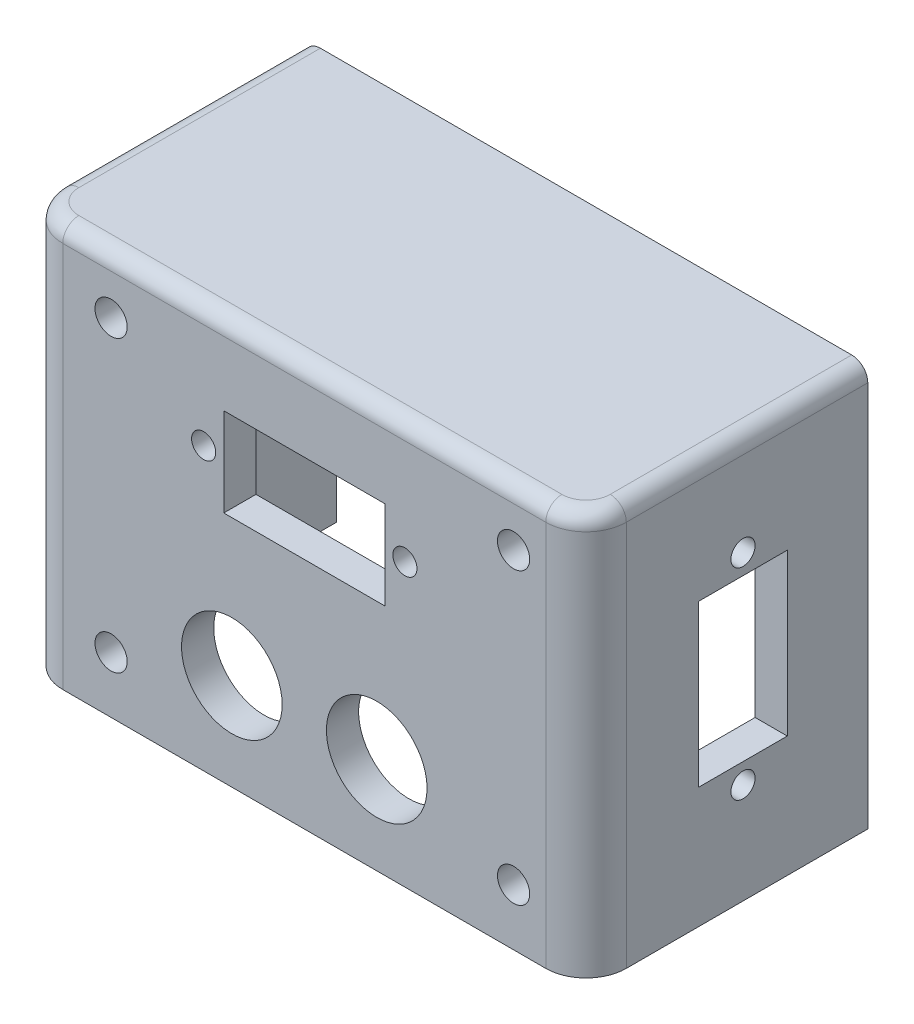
ISO-10303-21;
HEADER;
FILE_DESCRIPTION(('STEP AP214'),'2;1');
FILE_NAME('part.step','',(''),(''),'','','');
FILE_SCHEMA(('AUTOMOTIVE_DESIGN { 1 0 10303 214 1 1 1 1 }'));
ENDSEC;
DATA;
#1=APPLICATION_CONTEXT('core data for automotive mechanical design processes');
#2=APPLICATION_PROTOCOL_DEFINITION('international standard','automotive_design',2000,#1);
#3=PRODUCT_CONTEXT('',#1,'mechanical');
#4=PRODUCT('Part','Part','',(#3));
#5=PRODUCT_RELATED_PRODUCT_CATEGORY('part','',(#4));
#6=PRODUCT_DEFINITION_FORMATION('','',#4);
#7=PRODUCT_DEFINITION_CONTEXT('part definition',#1,'design');
#8=PRODUCT_DEFINITION('design','',#6,#7);
#9=PRODUCT_DEFINITION_SHAPE('','',#8);
#10=(LENGTH_UNIT() NAMED_UNIT(*) SI_UNIT(.MILLI.,.METRE.));
#11=(NAMED_UNIT(*) PLANE_ANGLE_UNIT() SI_UNIT($,.RADIAN.));
#12=(NAMED_UNIT(*) SI_UNIT($,.STERADIAN.) SOLID_ANGLE_UNIT());
#13=UNCERTAINTY_MEASURE_WITH_UNIT(LENGTH_MEASURE(1.E-05),#10,'distance_accuracy_value','');
#14=(GEOMETRIC_REPRESENTATION_CONTEXT(3) GLOBAL_UNCERTAINTY_ASSIGNED_CONTEXT((#13)) GLOBAL_UNIT_ASSIGNED_CONTEXT((#10,
#11,#12)) REPRESENTATION_CONTEXT('',''));
#15=CARTESIAN_POINT('',(0.,0.,0.));
#16=DIRECTION('',(0.,0.,1.));
#17=DIRECTION('',(1.,0.,0.));
#18=AXIS2_PLACEMENT_3D('',#15,#16,#17);
#19=CARTESIAN_POINT('',(66.,0.,0.));
#20=DIRECTION('',(1.,0.,0.));
#21=DIRECTION('',(0.,0.,-1.));
#22=AXIS2_PLACEMENT_3D('',#19,#20,#21);
#23=PLANE('',#22);
#24=DIRECTION('',(0.,0.,-1.));
#25=VECTOR('',#24,1.);
#26=CARTESIAN_POINT('',(66.,15.,0.));
#27=LINE('',#26,#25);
#28=CARTESIAN_POINT('',(66.,15.,21.));
#29=VERTEX_POINT('',#28);
#30=CARTESIAN_POINT('',(66.,15.,10.));
#31=VERTEX_POINT('',#30);
#32=EDGE_CURVE('E326',#29,#31,#27,.T.);
#33=ORIENTED_EDGE('',*,*,#32,.T.);
#34=DIRECTION('',(0.,1.,0.));
#35=VECTOR('',#34,1.);
#36=CARTESIAN_POINT('',(66.,0.,10.));
#37=LINE('',#36,#35);
#38=CARTESIAN_POINT('',(66.,35.,10.));
#39=VERTEX_POINT('',#38);
#40=EDGE_CURVE('E346',#31,#39,#37,.T.);
#41=ORIENTED_EDGE('',*,*,#40,.T.);
#42=DIRECTION('',(0.,0.,1.));
#43=VECTOR('',#42,1.);
#44=CARTESIAN_POINT('',(66.,35.,0.));
#45=LINE('',#44,#43);
#46=CARTESIAN_POINT('',(66.,35.,21.));
#47=VERTEX_POINT('',#46);
#48=EDGE_CURVE('E343',#39,#47,#45,.T.);
#49=ORIENTED_EDGE('',*,*,#48,.T.);
#50=DIRECTION('',(0.,-1.,0.));
#51=VECTOR('',#50,1.);
#52=CARTESIAN_POINT('',(66.,0.,21.));
#53=LINE('',#52,#51);
#54=EDGE_CURVE('E340',#47,#29,#53,.T.);
#55=ORIENTED_EDGE('',*,*,#54,.T.);
#56=EDGE_LOOP('',(#33,#41,#49,#55));
#57=FACE_BOUND('',#56,.T.);
#58=CARTESIAN_POINT('',(66.,12.5,15.5));
#59=DIRECTION('',(1.,0.,0.));
#60=DIRECTION('',(0.,0.,-1.));
#61=AXIS2_PLACEMENT_3D('',#58,#59,#60);
#62=CIRCLE('',#61,1.5);
#63=CARTESIAN_POINT('',(66.,12.5,14.));
#64=VERTEX_POINT('',#63);
#65=EDGE_CURVE('E296',#64,#64,#62,.T.);
#66=ORIENTED_EDGE('',*,*,#65,.T.);
#67=EDGE_LOOP('',(#66));
#68=FACE_BOUND('',#67,.T.);
#69=CARTESIAN_POINT('',(66.,37.5,15.5));
#70=DIRECTION('',(1.,0.,0.));
#71=DIRECTION('',(0.,0.,-1.));
#72=AXIS2_PLACEMENT_3D('',#69,#70,#71);
#73=CIRCLE('',#72,1.5);
#74=CARTESIAN_POINT('',(66.,37.5,14.));
#75=VERTEX_POINT('',#74);
#76=EDGE_CURVE('E286',#75,#75,#73,.T.);
#77=ORIENTED_EDGE('',*,*,#76,.T.);
#78=EDGE_LOOP('',(#77));
#79=FACE_BOUND('',#78,.T.);
#80=DIRECTION('',(0.,0.,-1.));
#81=VECTOR('',#80,1.);
#82=CARTESIAN_POINT('',(66.,48.,0.));
#83=LINE('',#82,#81);
#84=CARTESIAN_POINT('',(66.,48.,29.));
#85=VERTEX_POINT('',#84);
#86=CARTESIAN_POINT('',(66.,48.,0.));
#87=VERTEX_POINT('',#86);
#88=EDGE_CURVE('E268',#85,#87,#83,.T.);
#89=ORIENTED_EDGE('',*,*,#88,.T.);
#90=DIRECTION('',(0.,1.,0.));
#91=VECTOR('',#90,1.);
#92=CARTESIAN_POINT('',(66.,0.,0.));
#93=LINE('',#92,#91);
#94=CARTESIAN_POINT('',(66.,0.,0.));
#95=VERTEX_POINT('',#94);
#96=EDGE_CURVE('E388',#95,#87,#93,.T.);
#97=ORIENTED_EDGE('',*,*,#96,.F.);
#98=DIRECTION('',(0.,0.,-1.));
#99=VECTOR('',#98,1.);
#100=CARTESIAN_POINT('',(66.,0.,0.));
#101=LINE('',#100,#99);
#102=CARTESIAN_POINT('',(66.,0.,29.));
#103=VERTEX_POINT('',#102);
#104=EDGE_CURVE('E373',#103,#95,#101,.T.);
#105=ORIENTED_EDGE('',*,*,#104,.F.);
#106=DIRECTION('',(0.,1.,0.));
#107=VECTOR('',#106,1.);
#108=CARTESIAN_POINT('',(66.,0.,29.));
#109=LINE('',#108,#107);
#110=EDGE_CURVE('E389',#103,#85,#109,.T.);
#111=ORIENTED_EDGE('',*,*,#110,.T.);
#112=EDGE_LOOP('',(#89,#97,#105,#111));
#113=FACE_BOUND('',#112,.T.);
#114=ADVANCED_FACE('F35',(#57,#68,#79,#113),#23,.F.);
#115=CARTESIAN_POINT('',(64.,0.,29.));
#116=DIRECTION('',(0.,1.,0.));
#117=DIRECTION('',(0.,0.,1.));
#118=AXIS2_PLACEMENT_3D('',#115,#116,#117);
#119=CYLINDRICAL_SURFACE('',#118,1.99999999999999);
#120=CARTESIAN_POINT('',(64.,48.,29.));
#121=DIRECTION('',(0.,1.,0.));
#122=DIRECTION('',(0.,0.,1.));
#123=AXIS2_PLACEMENT_3D('',#120,#121,#122);
#124=CIRCLE('',#123,1.99999999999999);
#125=CARTESIAN_POINT('',(64.,48.,31.));
#126=VERTEX_POINT('',#125);
#127=EDGE_CURVE('E276',#85,#126,#124,.F.);
#128=ORIENTED_EDGE('',*,*,#127,.F.);
#129=ORIENTED_EDGE('',*,*,#110,.F.);
#130=CARTESIAN_POINT('',(64.,0.,29.));
#131=DIRECTION('',(0.,1.,0.));
#132=DIRECTION('',(0.,0.,1.));
#133=AXIS2_PLACEMENT_3D('',#130,#131,#132);
#134=CIRCLE('',#133,1.99999999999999);
#135=CARTESIAN_POINT('',(64.,0.,31.));
#136=VERTEX_POINT('',#135);
#137=EDGE_CURVE('E385',#136,#103,#134,.T.);
#138=ORIENTED_EDGE('',*,*,#137,.F.);
#139=DIRECTION('',(0.,1.,0.));
#140=VECTOR('',#139,1.);
#141=CARTESIAN_POINT('',(64.,0.,31.));
#142=LINE('',#141,#140);
#143=EDGE_CURVE('E393',#136,#126,#142,.T.);
#144=ORIENTED_EDGE('',*,*,#143,.T.);
#145=EDGE_LOOP('',(#128,#129,#138,#144));
#146=FACE_BOUND('',#145,.T.);
#147=ADVANCED_FACE('F550',(#146),#119,.F.);
#148=CARTESIAN_POINT('',(64.,0.,31.));
#149=DIRECTION('',(0.,0.,1.));
#150=DIRECTION('',(1.,0.,0.));
#151=AXIS2_PLACEMENT_3D('',#148,#149,#150);
#152=PLANE('',#151);
#153=CARTESIAN_POINT('',(47.5,35.,31.));
#154=DIRECTION('',(0.,0.,1.));
#155=DIRECTION('',(1.,0.,0.));
#156=AXIS2_PLACEMENT_3D('',#153,#154,#155);
#157=CIRCLE('',#156,1.5);
#158=CARTESIAN_POINT('',(49.,35.,31.));
#159=VERTEX_POINT('',#158);
#160=EDGE_CURVE('E932',#159,#159,#157,.F.);
#161=ORIENTED_EDGE('',*,*,#160,.F.);
#162=EDGE_LOOP('',(#161));
#163=FACE_BOUND('',#162,.T.);
#164=CARTESIAN_POINT('',(22.5,35.,31.));
#165=DIRECTION('',(0.,0.,1.));
#166=DIRECTION('',(1.,0.,0.));
#167=AXIS2_PLACEMENT_3D('',#164,#165,#166);
#168=CIRCLE('',#167,1.5);
#169=CARTESIAN_POINT('',(24.,35.,31.));
#170=VERTEX_POINT('',#169);
#171=EDGE_CURVE('E936',#170,#170,#168,.F.);
#172=ORIENTED_EDGE('',*,*,#171,.F.);
#173=EDGE_LOOP('',(#172));
#174=FACE_BOUND('',#173,.T.);
#175=DIRECTION('',(1.,0.,0.));
#176=VECTOR('',#175,1.);
#177=CARTESIAN_POINT('',(25.,40.,31.));
#178=LINE('',#177,#176);
#179=CARTESIAN_POINT('',(25.,40.,31.));
#180=VERTEX_POINT('',#179);
#181=CARTESIAN_POINT('',(45.,40.,31.));
#182=VERTEX_POINT('',#181);
#183=EDGE_CURVE('E235',#180,#182,#178,.T.);
#184=ORIENTED_EDGE('',*,*,#183,.F.);
#185=DIRECTION('',(0.,1.,0.));
#186=VECTOR('',#185,1.);
#187=CARTESIAN_POINT('',(25.,29.,31.));
#188=LINE('',#187,#186);
#189=CARTESIAN_POINT('',(25.,29.,31.));
#190=VERTEX_POINT('',#189);
#191=EDGE_CURVE('E217',#190,#180,#188,.T.);
#192=ORIENTED_EDGE('',*,*,#191,.F.);
#193=DIRECTION('',(-1.,0.,0.));
#194=VECTOR('',#193,1.);
#195=CARTESIAN_POINT('',(25.,29.,31.));
#196=LINE('',#195,#194);
#197=CARTESIAN_POINT('',(45.,29.,31.));
#198=VERTEX_POINT('',#197);
#199=EDGE_CURVE('E226',#198,#190,#196,.T.);
#200=ORIENTED_EDGE('',*,*,#199,.F.);
#201=DIRECTION('',(0.,-1.,0.));
#202=VECTOR('',#201,1.);
#203=CARTESIAN_POINT('',(45.,29.,31.));
#204=LINE('',#203,#202);
#205=EDGE_CURVE('E52',#182,#198,#204,.T.);
#206=ORIENTED_EDGE('',*,*,#205,.F.);
#207=EDGE_LOOP('',(#184,#192,#200,#206));
#208=FACE_BOUND('',#207,.T.);
#209=CARTESIAN_POINT('',(44.,12.,31.));
#210=DIRECTION('',(0.,0.,1.));
#211=DIRECTION('',(1.,0.,0.));
#212=AXIS2_PLACEMENT_3D('',#209,#210,#211);
#213=CIRCLE('',#212,6.25);
#214=CARTESIAN_POINT('',(50.25,12.,31.));
#215=VERTEX_POINT('',#214);
#216=EDGE_CURVE('E254',#215,#215,#213,.F.);
#217=ORIENTED_EDGE('',*,*,#216,.F.);
#218=EDGE_LOOP('',(#217));
#219=FACE_BOUND('',#218,.T.);
#220=CARTESIAN_POINT('',(26.,12.,31.));
#221=DIRECTION('',(0.,0.,1.));
#222=DIRECTION('',(1.,0.,0.));
#223=AXIS2_PLACEMENT_3D('',#220,#221,#222);
#224=CIRCLE('',#223,6.25);
#225=CARTESIAN_POINT('',(32.25,12.,31.));
#226=VERTEX_POINT('',#225);
#227=EDGE_CURVE('E260',#226,#226,#224,.F.);
#228=ORIENTED_EDGE('',*,*,#227,.F.);
#229=EDGE_LOOP('',(#228));
#230=FACE_BOUND('',#229,.T.);
#231=CARTESIAN_POINT('',(11.,43.,31.));
#232=DIRECTION('',(0.,0.,1.));
#233=DIRECTION('',(1.,0.,0.));
#234=AXIS2_PLACEMENT_3D('',#231,#232,#233);
#235=CIRCLE('',#234,2.);
#236=CARTESIAN_POINT('',(13.,43.,31.));
#237=VERTEX_POINT('',#236);
#238=EDGE_CURVE('E370',#237,#237,#235,.F.);
#239=ORIENTED_EDGE('',*,*,#238,.F.);
#240=EDGE_LOOP('',(#239));
#241=FACE_BOUND('',#240,.T.);
#242=CARTESIAN_POINT('',(11.,7.00000000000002,31.));
#243=DIRECTION('',(0.,0.,1.));
#244=DIRECTION('',(1.,0.,0.));
#245=AXIS2_PLACEMENT_3D('',#242,#243,#244);
#246=CIRCLE('',#245,2.);
#247=CARTESIAN_POINT('',(13.,7.00000000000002,31.));
#248=VERTEX_POINT('',#247);
#249=EDGE_CURVE('E364',#248,#248,#246,.F.);
#250=ORIENTED_EDGE('',*,*,#249,.F.);
#251=EDGE_LOOP('',(#250));
#252=FACE_BOUND('',#251,.T.);
#253=CARTESIAN_POINT('',(61.,7.00000000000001,31.));
#254=DIRECTION('',(0.,0.,1.));
#255=DIRECTION('',(1.,0.,0.));
#256=AXIS2_PLACEMENT_3D('',#253,#254,#255);
#257=CIRCLE('',#256,1.99999999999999);
#258=CARTESIAN_POINT('',(63.,7.00000000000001,31.));
#259=VERTEX_POINT('',#258);
#260=EDGE_CURVE('E358',#259,#259,#257,.F.);
#261=ORIENTED_EDGE('',*,*,#260,.F.);
#262=EDGE_LOOP('',(#261));
#263=FACE_BOUND('',#262,.T.);
#264=CARTESIAN_POINT('',(61.,43.,31.));
#265=DIRECTION('',(0.,0.,1.));
#266=DIRECTION('',(1.,0.,0.));
#267=AXIS2_PLACEMENT_3D('',#264,#265,#266);
#268=CIRCLE('',#267,1.99999999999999);
#269=CARTESIAN_POINT('',(63.,43.,31.));
#270=VERTEX_POINT('',#269);
#271=EDGE_CURVE('E352',#270,#270,#268,.F.);
#272=ORIENTED_EDGE('',*,*,#271,.F.);
#273=EDGE_LOOP('',(#272));
#274=FACE_BOUND('',#273,.T.);
#275=DIRECTION('',(1.,0.,0.));
#276=VECTOR('',#275,1.);
#277=CARTESIAN_POINT('',(3.99999999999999,48.,31.));
#278=LINE('',#277,#276);
#279=CARTESIAN_POINT('',(5.99999999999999,48.,31.));
#280=VERTEX_POINT('',#279);
#281=EDGE_CURVE('E266',#280,#126,#278,.T.);
#282=ORIENTED_EDGE('',*,*,#281,.T.);
#283=ORIENTED_EDGE('',*,*,#143,.F.);
#284=DIRECTION('',(1.,0.,0.));
#285=VECTOR('',#284,1.);
#286=CARTESIAN_POINT('',(64.,0.,31.));
#287=LINE('',#286,#285);
#288=CARTESIAN_POINT('',(5.99999999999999,0.,31.));
#289=VERTEX_POINT('',#288);
#290=EDGE_CURVE('E382',#289,#136,#287,.T.);
#291=ORIENTED_EDGE('',*,*,#290,.F.);
#292=DIRECTION('',(0.,1.,0.));
#293=VECTOR('',#292,1.);
#294=CARTESIAN_POINT('',(5.99999999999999,0.,31.));
#295=LINE('',#294,#293);
#296=EDGE_CURVE('E396',#289,#280,#295,.T.);
#297=ORIENTED_EDGE('',*,*,#296,.T.);
#298=EDGE_LOOP('',(#282,#283,#291,#297));
#299=FACE_BOUND('',#298,.T.);
#300=ADVANCED_FACE('F232',(#163,#174,#208,#219,#230,#241,#252,#263,#274,#299),#152,.F.);
#301=CARTESIAN_POINT('',(5.99999999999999,0.,29.));
#302=DIRECTION('',(0.,1.,0.));
#303=DIRECTION('',(0.,0.,1.));
#304=AXIS2_PLACEMENT_3D('',#301,#302,#303);
#305=CYLINDRICAL_SURFACE('',#304,2.);
#306=CARTESIAN_POINT('',(5.99999999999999,48.,29.));
#307=DIRECTION('',(0.,1.,0.));
#308=DIRECTION('',(0.,0.,1.));
#309=AXIS2_PLACEMENT_3D('',#306,#307,#308);
#310=CIRCLE('',#309,2.);
#311=CARTESIAN_POINT('',(3.99999999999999,48.,29.));
#312=VERTEX_POINT('',#311);
#313=EDGE_CURVE('E273',#280,#312,#310,.F.);
#314=ORIENTED_EDGE('',*,*,#313,.F.);
#315=ORIENTED_EDGE('',*,*,#296,.F.);
#316=CARTESIAN_POINT('',(5.99999999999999,0.,29.));
#317=DIRECTION('',(0.,1.,0.));
#318=DIRECTION('',(0.,0.,1.));
#319=AXIS2_PLACEMENT_3D('',#316,#317,#318);
#320=CIRCLE('',#319,2.);
#321=CARTESIAN_POINT('',(3.99999999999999,0.,29.));
#322=VERTEX_POINT('',#321);
#323=EDGE_CURVE('E379',#322,#289,#320,.T.);
#324=ORIENTED_EDGE('',*,*,#323,.F.);
#325=DIRECTION('',(0.,1.,0.));
#326=VECTOR('',#325,1.);
#327=CARTESIAN_POINT('',(3.99999999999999,0.,29.));
#328=LINE('',#327,#326);
#329=EDGE_CURVE('E399',#322,#312,#328,.T.);
#330=ORIENTED_EDGE('',*,*,#329,.T.);
#331=EDGE_LOOP('',(#314,#315,#324,#330));
#332=FACE_BOUND('',#331,.T.);
#333=ADVANCED_FACE('F599',(#332),#305,.F.);
#334=CARTESIAN_POINT('',(3.99999999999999,0.,0.));
#335=DIRECTION('',(-1.,0.,0.));
#336=DIRECTION('',(0.,0.,1.));
#337=AXIS2_PLACEMENT_3D('',#334,#335,#336);
#338=PLANE('',#337);
#339=DIRECTION('',(0.,0.,-1.));
#340=VECTOR('',#339,1.);
#341=CARTESIAN_POINT('',(3.99999999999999,35.,0.));
#342=LINE('',#341,#340);
#343=CARTESIAN_POINT('',(3.99999999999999,35.,21.));
#344=VERTEX_POINT('',#343);
#345=CARTESIAN_POINT('',(3.99999999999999,35.,10.));
#346=VERTEX_POINT('',#345);
#347=EDGE_CURVE('E446',#344,#346,#342,.T.);
#348=ORIENTED_EDGE('',*,*,#347,.T.);
#349=DIRECTION('',(0.,-1.,0.));
#350=VECTOR('',#349,1.);
#351=CARTESIAN_POINT('',(3.99999999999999,0.,10.));
#352=LINE('',#351,#350);
#353=CARTESIAN_POINT('',(3.99999999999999,15.,10.));
#354=VERTEX_POINT('',#353);
#355=EDGE_CURVE('E449',#346,#354,#352,.T.);
#356=ORIENTED_EDGE('',*,*,#355,.T.);
#357=DIRECTION('',(0.,0.,1.));
#358=VECTOR('',#357,1.);
#359=CARTESIAN_POINT('',(3.99999999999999,15.,0.));
#360=LINE('',#359,#358);
#361=CARTESIAN_POINT('',(3.99999999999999,15.,21.));
#362=VERTEX_POINT('',#361);
#363=EDGE_CURVE('E440',#354,#362,#360,.T.);
#364=ORIENTED_EDGE('',*,*,#363,.T.);
#365=DIRECTION('',(0.,1.,0.));
#366=VECTOR('',#365,1.);
#367=CARTESIAN_POINT('',(3.99999999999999,0.,21.));
#368=LINE('',#367,#366);
#369=EDGE_CURVE('E443',#362,#344,#368,.T.);
#370=ORIENTED_EDGE('',*,*,#369,.T.);
#371=EDGE_LOOP('',(#348,#356,#364,#370));
#372=FACE_BOUND('',#371,.T.);
#373=CARTESIAN_POINT('',(3.99999999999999,12.5,15.5));
#374=DIRECTION('',(-1.,0.,0.));
#375=DIRECTION('',(0.,0.,1.));
#376=AXIS2_PLACEMENT_3D('',#373,#374,#375);
#377=CIRCLE('',#376,1.5);
#378=CARTESIAN_POINT('',(3.99999999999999,12.5,17.));
#379=VERTEX_POINT('',#378);
#380=EDGE_CURVE('E293',#379,#379,#377,.T.);
#381=ORIENTED_EDGE('',*,*,#380,.T.);
#382=EDGE_LOOP('',(#381));
#383=FACE_BOUND('',#382,.T.);
#384=CARTESIAN_POINT('',(3.99999999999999,37.5,15.5));
#385=DIRECTION('',(-1.,0.,0.));
#386=DIRECTION('',(0.,0.,1.));
#387=AXIS2_PLACEMENT_3D('',#384,#385,#386);
#388=CIRCLE('',#387,1.5);
#389=CARTESIAN_POINT('',(3.99999999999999,37.5,17.));
#390=VERTEX_POINT('',#389);
#391=EDGE_CURVE('E283',#390,#390,#388,.T.);
#392=ORIENTED_EDGE('',*,*,#391,.T.);
#393=EDGE_LOOP('',(#392));
#394=FACE_BOUND('',#393,.T.);
#395=DIRECTION('',(0.,0.,1.));
#396=VECTOR('',#395,1.);
#397=CARTESIAN_POINT('',(3.99999999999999,48.,0.));
#398=LINE('',#397,#396);
#399=CARTESIAN_POINT('',(3.99999999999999,48.,0.));
#400=VERTEX_POINT('',#399);
#401=EDGE_CURVE('E264',#400,#312,#398,.T.);
#402=ORIENTED_EDGE('',*,*,#401,.T.);
#403=ORIENTED_EDGE('',*,*,#329,.F.);
#404=DIRECTION('',(0.,0.,1.));
#405=VECTOR('',#404,1.);
#406=CARTESIAN_POINT('',(3.99999999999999,0.,0.));
#407=LINE('',#406,#405);
#408=CARTESIAN_POINT('',(3.99999999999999,0.,0.));
#409=VERTEX_POINT('',#408);
#410=EDGE_CURVE('E376',#409,#322,#407,.T.);
#411=ORIENTED_EDGE('',*,*,#410,.F.);
#412=DIRECTION('',(0.,1.,0.));
#413=VECTOR('',#412,1.);
#414=CARTESIAN_POINT('',(3.99999999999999,0.,0.));
#415=LINE('',#414,#413);
#416=EDGE_CURVE('E402',#409,#400,#415,.T.);
#417=ORIENTED_EDGE('',*,*,#416,.T.);
#418=EDGE_LOOP('',(#402,#403,#411,#417));
#419=FACE_BOUND('',#418,.T.);
#420=ADVANCED_FACE('F561',(#372,#383,#394,#419),#338,.F.);
#421=CARTESIAN_POINT('',(0.,0.,35.));
#422=DIRECTION('',(1.,0.,0.));
#423=DIRECTION('',(0.,1.,0.));
#424=AXIS2_PLACEMENT_3D('',#421,#422,#423);
#425=PLANE('',#424);
#426=CARTESIAN_POINT('',(0.,37.5,15.5));
#427=DIRECTION('',(-1.,0.,0.));
#428=DIRECTION('',(0.,-1.,0.));
#429=AXIS2_PLACEMENT_3D('',#426,#427,#428);
#430=CIRCLE('',#429,1.5);
#431=CARTESIAN_POINT('',(0.,36.,15.5));
#432=VERTEX_POINT('',#431);
#433=EDGE_CURVE('E279',#432,#432,#430,.T.);
#434=ORIENTED_EDGE('',*,*,#433,.F.);
#435=EDGE_LOOP('',(#434));
#436=FACE_BOUND('',#435,.T.);
#437=CARTESIAN_POINT('',(0.,12.5,15.5));
#438=DIRECTION('',(-1.,0.,0.));
#439=DIRECTION('',(0.,-1.,0.));
#440=AXIS2_PLACEMENT_3D('',#437,#438,#439);
#441=CIRCLE('',#440,1.5);
#442=CARTESIAN_POINT('',(0.,11.,15.5));
#443=VERTEX_POINT('',#442);
#444=EDGE_CURVE('E289',#443,#443,#441,.T.);
#445=ORIENTED_EDGE('',*,*,#444,.F.);
#446=EDGE_LOOP('',(#445));
#447=FACE_BOUND('',#446,.T.);
#448=DIRECTION('',(0.,0.,1.));
#449=VECTOR('',#448,1.);
#450=CARTESIAN_POINT('',(0.,15.,10.));
#451=LINE('',#450,#449);
#452=CARTESIAN_POINT('',(0.,15.,10.));
#453=VERTEX_POINT('',#452);
#454=CARTESIAN_POINT('',(0.,15.,21.));
#455=VERTEX_POINT('',#454);
#456=EDGE_CURVE('E315',#453,#455,#451,.T.);
#457=ORIENTED_EDGE('',*,*,#456,.F.);
#458=DIRECTION('',(0.,-1.,0.));
#459=VECTOR('',#458,1.);
#460=CARTESIAN_POINT('',(0.,35.,10.));
#461=LINE('',#460,#459);
#462=CARTESIAN_POINT('',(0.,35.,10.));
#463=VERTEX_POINT('',#462);
#464=EDGE_CURVE('E299',#463,#453,#461,.T.);
#465=ORIENTED_EDGE('',*,*,#464,.F.);
#466=DIRECTION('',(0.,0.,-1.));
#467=VECTOR('',#466,1.);
#468=CARTESIAN_POINT('',(0.,35.,10.));
#469=LINE('',#468,#467);
#470=CARTESIAN_POINT('',(0.,35.,21.));
#471=VERTEX_POINT('',#470);
#472=EDGE_CURVE('E304',#471,#463,#469,.T.);
#473=ORIENTED_EDGE('',*,*,#472,.F.);
#474=DIRECTION('',(0.,1.,0.));
#475=VECTOR('',#474,1.);
#476=CARTESIAN_POINT('',(0.,35.,21.));
#477=LINE('',#476,#475);
#478=EDGE_CURVE('E318',#455,#471,#477,.T.);
#479=ORIENTED_EDGE('',*,*,#478,.F.);
#480=EDGE_LOOP('',(#457,#465,#473,#479));
#481=FACE_BOUND('',#480,.T.);
#482=DIRECTION('',(0.,-1.,0.));
#483=VECTOR('',#482,1.);
#484=CARTESIAN_POINT('',(0.,0.,30.));
#485=LINE('',#484,#483);
#486=CARTESIAN_POINT('',(0.,0.,30.));
#487=VERTEX_POINT('',#486);
#488=CARTESIAN_POINT('',(0.,48.,30.));
#489=VERTEX_POINT('',#488);
#490=EDGE_CURVE('E437',#487,#489,#485,.F.);
#491=ORIENTED_EDGE('',*,*,#490,.T.);
#492=DIRECTION('',(0.,0.,-1.));
#493=VECTOR('',#492,1.);
#494=CARTESIAN_POINT('',(0.,48.,35.));
#495=LINE('',#494,#493);
#496=CARTESIAN_POINT('',(0.,48.,0.));
#497=VERTEX_POINT('',#496);
#498=EDGE_CURVE('E12',#489,#497,#495,.T.);
#499=ORIENTED_EDGE('',*,*,#498,.T.);
#500=DIRECTION('',(0.,-1.,0.));
#501=VECTOR('',#500,1.);
#502=CARTESIAN_POINT('',(0.,0.,0.));
#503=LINE('',#502,#501);
#504=CARTESIAN_POINT('',(0.,0.,0.));
#505=VERTEX_POINT('',#504);
#506=EDGE_CURVE('E392',#497,#505,#503,.T.);
#507=ORIENTED_EDGE('',*,*,#506,.T.);
#508=DIRECTION('',(0.,0.,-1.));
#509=VECTOR('',#508,1.);
#510=CARTESIAN_POINT('',(0.,0.,35.));
#511=LINE('',#510,#509);
#512=EDGE_CURVE('E423',#487,#505,#511,.T.);
#513=ORIENTED_EDGE('',*,*,#512,.F.);
#514=EDGE_LOOP('',(#491,#499,#507,#513));
#515=FACE_BOUND('',#514,.T.);
#516=ADVANCED_FACE('F500',(#436,#447,#481,#515),#425,.F.);
#517=CARTESIAN_POINT('',(0.,0.,35.));
#518=DIRECTION('',(0.,1.,0.));
#519=DIRECTION('',(0.,0.,1.));
#520=AXIS2_PLACEMENT_3D('',#517,#518,#519);
#521=PLANE('',#520);
#522=ORIENTED_EDGE('',*,*,#137,.T.);
#523=ORIENTED_EDGE('',*,*,#104,.T.);
#524=DIRECTION('',(1.,0.,0.));
#525=VECTOR('',#524,1.);
#526=CARTESIAN_POINT('',(0.,0.,0.));
#527=LINE('',#526,#525);
#528=CARTESIAN_POINT('',(70.,0.,0.));
#529=VERTEX_POINT('',#528);
#530=EDGE_CURVE('E412',#95,#529,#527,.T.);
#531=ORIENTED_EDGE('',*,*,#530,.T.);
#532=DIRECTION('',(0.,0.,-1.));
#533=VECTOR('',#532,1.);
#534=CARTESIAN_POINT('',(70.,0.,35.));
#535=LINE('',#534,#533);
#536=CARTESIAN_POINT('',(70.,0.,30.));
#537=VERTEX_POINT('',#536);
#538=EDGE_CURVE('E409',#537,#529,#535,.T.);
#539=ORIENTED_EDGE('',*,*,#538,.F.);
#540=CARTESIAN_POINT('',(65.,0.,30.));
#541=DIRECTION('',(0.,1.,0.));
#542=DIRECTION('',(0.,0.,1.));
#543=AXIS2_PLACEMENT_3D('',#540,#541,#542);
#544=CIRCLE('',#543,5.);
#545=CARTESIAN_POINT('',(65.,0.,35.));
#546=VERTEX_POINT('',#545);
#547=EDGE_CURVE('E435',#537,#546,#544,.F.);
#548=ORIENTED_EDGE('',*,*,#547,.T.);
#549=DIRECTION('',(1.,0.,0.));
#550=VECTOR('',#549,1.);
#551=CARTESIAN_POINT('',(0.,0.,35.));
#552=LINE('',#551,#550);
#553=CARTESIAN_POINT('',(5.,0.,35.));
#554=VERTEX_POINT('',#553);
#555=EDGE_CURVE('E406',#554,#546,#552,.T.);
#556=ORIENTED_EDGE('',*,*,#555,.F.);
#557=CARTESIAN_POINT('',(5.,0.,30.));
#558=DIRECTION('',(0.,1.,0.));
#559=DIRECTION('',(0.,0.,1.));
#560=AXIS2_PLACEMENT_3D('',#557,#558,#559);
#561=CIRCLE('',#560,5.);
#562=EDGE_CURVE('E433',#554,#487,#561,.F.);
#563=ORIENTED_EDGE('',*,*,#562,.T.);
#564=ORIENTED_EDGE('',*,*,#512,.T.);
#565=EDGE_CURVE('E413',#505,#409,#527,.T.);
#566=ORIENTED_EDGE('',*,*,#565,.T.);
#567=ORIENTED_EDGE('',*,*,#410,.T.);
#568=ORIENTED_EDGE('',*,*,#323,.T.);
#569=ORIENTED_EDGE('',*,*,#290,.T.);
#570=EDGE_LOOP('',(#522,#523,#531,#539,#548,#556,#563,#564,#566,#567,#568,#569));
#571=FACE_BOUND('',#570,.T.);
#572=ADVANCED_FACE('F509',(#571),#521,.F.);
#573=CARTESIAN_POINT('',(70.,0.,35.));
#574=DIRECTION('',(-1.,0.,0.));
#575=DIRECTION('',(0.,-1.,0.));
#576=AXIS2_PLACEMENT_3D('',#573,#574,#575);
#577=PLANE('',#576);
#578=CARTESIAN_POINT('',(70.,37.5,15.5));
#579=DIRECTION('',(-1.,0.,0.));
#580=DIRECTION('',(0.,-1.,0.));
#581=AXIS2_PLACEMENT_3D('',#578,#579,#580);
#582=CIRCLE('',#581,1.5);
#583=CARTESIAN_POINT('',(70.,36.,15.5));
#584=VERTEX_POINT('',#583);
#585=EDGE_CURVE('E280',#584,#584,#582,.T.);
#586=ORIENTED_EDGE('',*,*,#585,.T.);
#587=EDGE_LOOP('',(#586));
#588=FACE_BOUND('',#587,.T.);
#589=CARTESIAN_POINT('',(70.,12.5,15.5));
#590=DIRECTION('',(-1.,0.,0.));
#591=DIRECTION('',(0.,-1.,0.));
#592=AXIS2_PLACEMENT_3D('',#589,#590,#591);
#593=CIRCLE('',#592,1.5);
#594=CARTESIAN_POINT('',(70.,11.,15.5));
#595=VERTEX_POINT('',#594);
#596=EDGE_CURVE('E290',#595,#595,#593,.T.);
#597=ORIENTED_EDGE('',*,*,#596,.T.);
#598=EDGE_LOOP('',(#597));
#599=FACE_BOUND('',#598,.T.);
#600=DIRECTION('',(0.,0.,-1.));
#601=VECTOR('',#600,1.);
#602=CARTESIAN_POINT('',(70.,35.,10.));
#603=LINE('',#602,#601);
#604=CARTESIAN_POINT('',(70.,35.,21.));
#605=VERTEX_POINT('',#604);
#606=CARTESIAN_POINT('',(70.,35.,10.));
#607=VERTEX_POINT('',#606);
#608=EDGE_CURVE('E310',#605,#607,#603,.T.);
#609=ORIENTED_EDGE('',*,*,#608,.T.);
#610=DIRECTION('',(0.,-1.,0.));
#611=VECTOR('',#610,1.);
#612=CARTESIAN_POINT('',(70.,35.,10.));
#613=LINE('',#612,#611);
#614=CARTESIAN_POINT('',(70.,15.,10.));
#615=VERTEX_POINT('',#614);
#616=EDGE_CURVE('E300',#607,#615,#613,.T.);
#617=ORIENTED_EDGE('',*,*,#616,.T.);
#618=DIRECTION('',(0.,0.,1.));
#619=VECTOR('',#618,1.);
#620=CARTESIAN_POINT('',(70.,15.,10.));
#621=LINE('',#620,#619);
#622=CARTESIAN_POINT('',(70.,15.,21.));
#623=VERTEX_POINT('',#622);
#624=EDGE_CURVE('E303',#615,#623,#621,.T.);
#625=ORIENTED_EDGE('',*,*,#624,.T.);
#626=DIRECTION('',(0.,1.,0.));
#627=VECTOR('',#626,1.);
#628=CARTESIAN_POINT('',(70.,35.,21.));
#629=LINE('',#628,#627);
#630=EDGE_CURVE('E307',#623,#605,#629,.T.);
#631=ORIENTED_EDGE('',*,*,#630,.T.);
#632=EDGE_LOOP('',(#609,#617,#625,#631));
#633=FACE_BOUND('',#632,.T.);
#634=DIRECTION('',(0.,1.,0.));
#635=VECTOR('',#634,1.);
#636=CARTESIAN_POINT('',(70.,0.,0.));
#637=LINE('',#636,#635);
#638=CARTESIAN_POINT('',(70.,48.,0.));
#639=VERTEX_POINT('',#638);
#640=EDGE_CURVE('E416',#529,#639,#637,.T.);
#641=ORIENTED_EDGE('',*,*,#640,.T.);
#642=DIRECTION('',(0.,0.,-1.));
#643=VECTOR('',#642,1.);
#644=CARTESIAN_POINT('',(70.,48.,35.));
#645=LINE('',#644,#643);
#646=CARTESIAN_POINT('',(70.,48.,30.));
#647=VERTEX_POINT('',#646);
#648=EDGE_CURVE('E471',#639,#647,#645,.F.);
#649=ORIENTED_EDGE('',*,*,#648,.T.);
#650=DIRECTION('',(0.,1.,0.));
#651=VECTOR('',#650,1.);
#652=CARTESIAN_POINT('',(70.,0.,30.));
#653=LINE('',#652,#651);
#654=EDGE_CURVE('E431',#647,#537,#653,.F.);
#655=ORIENTED_EDGE('',*,*,#654,.T.);
#656=ORIENTED_EDGE('',*,*,#538,.T.);
#657=EDGE_LOOP('',(#641,#649,#655,#656));
#658=FACE_BOUND('',#657,.T.);
#659=ADVANCED_FACE('F533',(#588,#599,#633,#658),#577,.F.);
#660=CARTESIAN_POINT('',(0.,50.,35.));
#661=DIRECTION('',(0.,-1.,0.));
#662=DIRECTION('',(0.,0.,-1.));
#663=AXIS2_PLACEMENT_3D('',#660,#661,#662);
#664=PLANE('',#663);
#665=CARTESIAN_POINT('',(65.,50.,30.));
#666=DIRECTION('',(0.,-1.,0.));
#667=DIRECTION('',(0.,0.,-1.));
#668=AXIS2_PLACEMENT_3D('',#665,#666,#667);
#669=CIRCLE('',#668,3.);
#670=CARTESIAN_POINT('',(65.,50.,33.));
#671=VERTEX_POINT('',#670);
#672=CARTESIAN_POINT('',(68.,50.,30.));
#673=VERTEX_POINT('',#672);
#674=EDGE_CURVE('E462',#671,#673,#669,.F.);
#675=ORIENTED_EDGE('',*,*,#674,.T.);
#676=DIRECTION('',(0.,0.,-1.));
#677=VECTOR('',#676,1.);
#678=CARTESIAN_POINT('',(68.,50.,35.));
#679=LINE('',#678,#677);
#680=CARTESIAN_POINT('',(68.,50.,0.));
#681=VERTEX_POINT('',#680);
#682=EDGE_CURVE('E464',#673,#681,#679,.T.);
#683=ORIENTED_EDGE('',*,*,#682,.T.);
#684=DIRECTION('',(-1.,0.,0.));
#685=VECTOR('',#684,1.);
#686=CARTESIAN_POINT('',(0.,50.,0.));
#687=LINE('',#686,#685);
#688=CARTESIAN_POINT('',(1.99999999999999,50.,0.));
#689=VERTEX_POINT('',#688);
#690=EDGE_CURVE('E410',#681,#689,#687,.T.);
#691=ORIENTED_EDGE('',*,*,#690,.T.);
#692=DIRECTION('',(0.,0.,-1.));
#693=VECTOR('',#692,1.);
#694=CARTESIAN_POINT('',(1.99999999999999,50.,35.));
#695=LINE('',#694,#693);
#696=CARTESIAN_POINT('',(1.99999999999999,50.,30.));
#697=VERTEX_POINT('',#696);
#698=EDGE_CURVE('E452',#689,#697,#695,.F.);
#699=ORIENTED_EDGE('',*,*,#698,.T.);
#700=CARTESIAN_POINT('',(4.99999999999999,50.,30.));
#701=DIRECTION('',(0.,-1.,0.));
#702=DIRECTION('',(0.,0.,-1.));
#703=AXIS2_PLACEMENT_3D('',#700,#701,#702);
#704=CIRCLE('',#703,3.);
#705=CARTESIAN_POINT('',(4.99999999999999,50.,33.));
#706=VERTEX_POINT('',#705);
#707=EDGE_CURVE('E458',#697,#706,#704,.F.);
#708=ORIENTED_EDGE('',*,*,#707,.T.);
#709=DIRECTION('',(-1.,0.,0.));
#710=VECTOR('',#709,1.);
#711=CARTESIAN_POINT('',(0.,50.,33.));
#712=LINE('',#711,#710);
#713=EDGE_CURVE('E460',#706,#671,#712,.F.);
#714=ORIENTED_EDGE('',*,*,#713,.T.);
#715=EDGE_LOOP('',(#675,#683,#691,#699,#708,#714));
#716=FACE_BOUND('',#715,.T.);
#717=ADVANCED_FACE('F527',(#716),#664,.F.);
#718=CARTESIAN_POINT('',(0.,50.,35.));
#719=DIRECTION('',(0.,0.,-1.));
#720=DIRECTION('',(-1.,0.,0.));
#721=AXIS2_PLACEMENT_3D('',#718,#719,#720);
#722=PLANE('',#721);
#723=CARTESIAN_POINT('',(47.5,35.,35.));
#724=DIRECTION('',(0.,0.,1.));
#725=DIRECTION('',(1.,0.,0.));
#726=AXIS2_PLACEMENT_3D('',#723,#724,#725);
#727=CIRCLE('',#726,1.5);
#728=CARTESIAN_POINT('',(49.,35.,35.));
#729=VERTEX_POINT('',#728);
#730=EDGE_CURVE('E929',#729,#729,#727,.T.);
#731=ORIENTED_EDGE('',*,*,#730,.F.);
#732=EDGE_LOOP('',(#731));
#733=FACE_BOUND('',#732,.T.);
#734=CARTESIAN_POINT('',(22.5,35.,35.));
#735=DIRECTION('',(0.,0.,1.));
#736=DIRECTION('',(1.,0.,0.));
#737=AXIS2_PLACEMENT_3D('',#734,#735,#736);
#738=CIRCLE('',#737,1.5);
#739=CARTESIAN_POINT('',(24.,35.,35.));
#740=VERTEX_POINT('',#739);
#741=EDGE_CURVE('E933',#740,#740,#738,.T.);
#742=ORIENTED_EDGE('',*,*,#741,.F.);
#743=EDGE_LOOP('',(#742));
#744=FACE_BOUND('',#743,.T.);
#745=DIRECTION('',(1.,0.,0.));
#746=VECTOR('',#745,1.);
#747=CARTESIAN_POINT('',(25.,29.,35.));
#748=LINE('',#747,#746);
#749=CARTESIAN_POINT('',(25.,29.,35.));
#750=VERTEX_POINT('',#749);
#751=CARTESIAN_POINT('',(45.,29.,35.));
#752=VERTEX_POINT('',#751);
#753=EDGE_CURVE('E237',#750,#752,#748,.T.);
#754=ORIENTED_EDGE('',*,*,#753,.F.);
#755=DIRECTION('',(0.,-1.,0.));
#756=VECTOR('',#755,1.);
#757=CARTESIAN_POINT('',(25.,29.,35.));
#758=LINE('',#757,#756);
#759=CARTESIAN_POINT('',(25.,40.,35.));
#760=VERTEX_POINT('',#759);
#761=EDGE_CURVE('E60',#760,#750,#758,.T.);
#762=ORIENTED_EDGE('',*,*,#761,.F.);
#763=DIRECTION('',(-1.,0.,0.));
#764=VECTOR('',#763,1.);
#765=CARTESIAN_POINT('',(25.,40.,35.));
#766=LINE('',#765,#764);
#767=CARTESIAN_POINT('',(45.,40.,35.));
#768=VERTEX_POINT('',#767);
#769=EDGE_CURVE('E223',#768,#760,#766,.T.);
#770=ORIENTED_EDGE('',*,*,#769,.F.);
#771=DIRECTION('',(0.,1.,0.));
#772=VECTOR('',#771,1.);
#773=CARTESIAN_POINT('',(45.,29.,35.));
#774=LINE('',#773,#772);
#775=EDGE_CURVE('E243',#752,#768,#774,.T.);
#776=ORIENTED_EDGE('',*,*,#775,.F.);
#777=EDGE_LOOP('',(#754,#762,#770,#776));
#778=FACE_BOUND('',#777,.T.);
#779=CARTESIAN_POINT('',(44.,12.,35.));
#780=DIRECTION('',(0.,0.,1.));
#781=DIRECTION('',(1.,0.,0.));
#782=AXIS2_PLACEMENT_3D('',#779,#780,#781);
#783=CIRCLE('',#782,6.25);
#784=CARTESIAN_POINT('',(50.25,12.,35.));
#785=VERTEX_POINT('',#784);
#786=EDGE_CURVE('E229',#785,#785,#783,.T.);
#787=ORIENTED_EDGE('',*,*,#786,.F.);
#788=EDGE_LOOP('',(#787));
#789=FACE_BOUND('',#788,.T.);
#790=CARTESIAN_POINT('',(26.,12.,35.));
#791=DIRECTION('',(0.,0.,1.));
#792=DIRECTION('',(1.,0.,0.));
#793=AXIS2_PLACEMENT_3D('',#790,#791,#792);
#794=CIRCLE('',#793,6.25);
#795=CARTESIAN_POINT('',(32.25,12.,35.));
#796=VERTEX_POINT('',#795);
#797=EDGE_CURVE('E257',#796,#796,#794,.T.);
#798=ORIENTED_EDGE('',*,*,#797,.F.);
#799=EDGE_LOOP('',(#798));
#800=FACE_BOUND('',#799,.T.);
#801=CARTESIAN_POINT('',(61.,43.,35.));
#802=DIRECTION('',(0.,0.,1.));
#803=DIRECTION('',(1.,0.,0.));
#804=AXIS2_PLACEMENT_3D('',#801,#802,#803);
#805=CIRCLE('',#804,1.99999999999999);
#806=CARTESIAN_POINT('',(63.,43.,35.));
#807=VERTEX_POINT('',#806);
#808=EDGE_CURVE('E349',#807,#807,#805,.T.);
#809=ORIENTED_EDGE('',*,*,#808,.F.);
#810=EDGE_LOOP('',(#809));
#811=FACE_BOUND('',#810,.T.);
#812=CARTESIAN_POINT('',(61.,7.00000000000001,35.));
#813=DIRECTION('',(0.,0.,1.));
#814=DIRECTION('',(1.,0.,0.));
#815=AXIS2_PLACEMENT_3D('',#812,#813,#814);
#816=CIRCLE('',#815,1.99999999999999);
#817=CARTESIAN_POINT('',(63.,7.00000000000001,35.));
#818=VERTEX_POINT('',#817);
#819=EDGE_CURVE('E355',#818,#818,#816,.T.);
#820=ORIENTED_EDGE('',*,*,#819,.F.);
#821=EDGE_LOOP('',(#820));
#822=FACE_BOUND('',#821,.T.);
#823=CARTESIAN_POINT('',(11.,7.00000000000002,35.));
#824=DIRECTION('',(0.,0.,1.));
#825=DIRECTION('',(1.,0.,0.));
#826=AXIS2_PLACEMENT_3D('',#823,#824,#825);
#827=CIRCLE('',#826,2.);
#828=CARTESIAN_POINT('',(13.,7.00000000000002,35.));
#829=VERTEX_POINT('',#828);
#830=EDGE_CURVE('E361',#829,#829,#827,.T.);
#831=ORIENTED_EDGE('',*,*,#830,.F.);
#832=EDGE_LOOP('',(#831));
#833=FACE_BOUND('',#832,.T.);
#834=CARTESIAN_POINT('',(11.,43.,35.));
#835=DIRECTION('',(0.,0.,1.));
#836=DIRECTION('',(1.,0.,0.));
#837=AXIS2_PLACEMENT_3D('',#834,#835,#836);
#838=CIRCLE('',#837,2.);
#839=CARTESIAN_POINT('',(13.,43.,35.));
#840=VERTEX_POINT('',#839);
#841=EDGE_CURVE('E367',#840,#840,#838,.T.);
#842=ORIENTED_EDGE('',*,*,#841,.F.);
#843=EDGE_LOOP('',(#842));
#844=FACE_BOUND('',#843,.T.);
#845=DIRECTION('',(0.,1.,0.));
#846=VECTOR('',#845,1.);
#847=CARTESIAN_POINT('',(65.,50.,35.));
#848=LINE('',#847,#846);
#849=CARTESIAN_POINT('',(65.,48.,35.));
#850=VERTEX_POINT('',#849);
#851=EDGE_CURVE('E428',#546,#850,#848,.T.);
#852=ORIENTED_EDGE('',*,*,#851,.T.);
#853=DIRECTION('',(-1.,0.,0.));
#854=VECTOR('',#853,1.);
#855=CARTESIAN_POINT('',(0.,48.,35.));
#856=LINE('',#855,#854);
#857=CARTESIAN_POINT('',(4.99999999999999,48.,35.));
#858=VERTEX_POINT('',#857);
#859=EDGE_CURVE('E475',#850,#858,#856,.T.);
#860=ORIENTED_EDGE('',*,*,#859,.T.);
#861=DIRECTION('',(0.,-1.,0.));
#862=VECTOR('',#861,1.);
#863=CARTESIAN_POINT('',(4.99999999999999,50.,35.));
#864=LINE('',#863,#862);
#865=EDGE_CURVE('E426',#858,#554,#864,.T.);
#866=ORIENTED_EDGE('',*,*,#865,.T.);
#867=ORIENTED_EDGE('',*,*,#555,.T.);
#868=EDGE_LOOP('',(#852,#860,#866,#867));
#869=FACE_BOUND('',#868,.T.);
#870=ADVANCED_FACE('F516',(#733,#744,#778,#789,#800,#811,#822,#833,#844,#869),#722,.F.);
#871=CARTESIAN_POINT('',(0.,50.,0.));
#872=DIRECTION('',(0.,0.,-1.));
#873=DIRECTION('',(-1.,0.,0.));
#874=AXIS2_PLACEMENT_3D('',#871,#872,#873);
#875=PLANE('',#874);
#876=ORIENTED_EDGE('',*,*,#690,.F.);
#877=CARTESIAN_POINT('',(68.,48.,0.));
#878=DIRECTION('',(0.,0.,-1.));
#879=DIRECTION('',(-1.,0.,0.));
#880=AXIS2_PLACEMENT_3D('',#877,#878,#879);
#881=CIRCLE('',#880,2.);
#882=EDGE_CURVE('E469',#681,#639,#881,.T.);
#883=ORIENTED_EDGE('',*,*,#882,.T.);
#884=ORIENTED_EDGE('',*,*,#640,.F.);
#885=ORIENTED_EDGE('',*,*,#530,.F.);
#886=ORIENTED_EDGE('',*,*,#96,.T.);
#887=DIRECTION('',(-1.,0.,0.));
#888=VECTOR('',#887,1.);
#889=CARTESIAN_POINT('',(3.99999999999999,48.,0.));
#890=LINE('',#889,#888);
#891=EDGE_CURVE('E270',#87,#400,#890,.T.);
#892=ORIENTED_EDGE('',*,*,#891,.T.);
#893=ORIENTED_EDGE('',*,*,#416,.F.);
#894=ORIENTED_EDGE('',*,*,#565,.F.);
#895=ORIENTED_EDGE('',*,*,#506,.F.);
#896=CARTESIAN_POINT('',(1.99999999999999,48.,0.));
#897=DIRECTION('',(0.,0.,-1.));
#898=DIRECTION('',(-1.,0.,0.));
#899=AXIS2_PLACEMENT_3D('',#896,#897,#898);
#900=CIRCLE('',#899,2.);
#901=EDGE_CURVE('E467',#497,#689,#900,.T.);
#902=ORIENTED_EDGE('',*,*,#901,.T.);
#903=EDGE_LOOP('',(#876,#883,#884,#885,#886,#892,#893,#894,#895,#902));
#904=FACE_BOUND('',#903,.T.);
#905=ADVANCED_FACE('F506',(#904),#875,.T.);
#906=CARTESIAN_POINT('',(65.,50.,30.));
#907=DIRECTION('',(0.,1.,0.));
#908=DIRECTION('',(-1.,0.,0.));
#909=AXIS2_PLACEMENT_3D('',#906,#907,#908);
#910=CYLINDRICAL_SURFACE('',#909,5.);
#911=ORIENTED_EDGE('',*,*,#654,.F.);
#912=CARTESIAN_POINT('',(65.,48.,30.));
#913=DIRECTION('',(0.,-1.,0.));
#914=DIRECTION('',(0.,0.,-1.));
#915=AXIS2_PLACEMENT_3D('',#912,#913,#914);
#916=CIRCLE('',#915,5.);
#917=EDGE_CURVE('E473',#647,#850,#916,.T.);
#918=ORIENTED_EDGE('',*,*,#917,.T.);
#919=ORIENTED_EDGE('',*,*,#851,.F.);
#920=ORIENTED_EDGE('',*,*,#547,.F.);
#921=EDGE_LOOP('',(#911,#918,#919,#920));
#922=FACE_BOUND('',#921,.T.);
#923=ADVANCED_FACE('F568',(#922),#910,.T.);
#924=CARTESIAN_POINT('',(4.99999999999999,50.,30.));
#925=DIRECTION('',(0.,-1.,0.));
#926=DIRECTION('',(1.,0.,0.));
#927=AXIS2_PLACEMENT_3D('',#924,#925,#926);
#928=CYLINDRICAL_SURFACE('',#927,5.);
#929=ORIENTED_EDGE('',*,*,#865,.F.);
#930=CARTESIAN_POINT('',(4.99999999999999,48.,30.));
#931=DIRECTION('',(0.,-1.,0.));
#932=DIRECTION('',(0.,0.,-1.));
#933=AXIS2_PLACEMENT_3D('',#930,#931,#932);
#934=CIRCLE('',#933,5.);
#935=EDGE_CURVE('E44',#858,#489,#934,.T.);
#936=ORIENTED_EDGE('',*,*,#935,.T.);
#937=ORIENTED_EDGE('',*,*,#490,.F.);
#938=ORIENTED_EDGE('',*,*,#562,.F.);
#939=EDGE_LOOP('',(#929,#936,#937,#938));
#940=FACE_BOUND('',#939,.T.);
#941=ADVANCED_FACE('F514',(#940),#928,.T.);
#942=CARTESIAN_POINT('',(11.,43.,-0.001000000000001));
#943=DIRECTION('',(0.,0.,1.));
#944=DIRECTION('',(1.,0.,0.));
#945=AXIS2_PLACEMENT_3D('',#942,#943,#944);
#946=CYLINDRICAL_SURFACE('',#945,2.);
#947=ORIENTED_EDGE('',*,*,#841,.T.);
#948=EDGE_LOOP('',(#947));
#949=FACE_BOUND('',#948,.T.);
#950=ORIENTED_EDGE('',*,*,#238,.T.);
#951=EDGE_LOOP('',(#950));
#952=FACE_BOUND('',#951,.T.);
#953=ADVANCED_FACE('F582',(#949,#952),#946,.F.);
#954=CARTESIAN_POINT('',(11.,7.00000000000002,-0.001000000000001));
#955=DIRECTION('',(0.,0.,1.));
#956=DIRECTION('',(1.,0.,0.));
#957=AXIS2_PLACEMENT_3D('',#954,#955,#956);
#958=CYLINDRICAL_SURFACE('',#957,2.);
#959=ORIENTED_EDGE('',*,*,#830,.T.);
#960=EDGE_LOOP('',(#959));
#961=FACE_BOUND('',#960,.T.);
#962=ORIENTED_EDGE('',*,*,#249,.T.);
#963=EDGE_LOOP('',(#962));
#964=FACE_BOUND('',#963,.T.);
#965=ADVANCED_FACE('F586',(#961,#964),#958,.F.);
#966=CARTESIAN_POINT('',(61.,7.00000000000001,-0.001000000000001));
#967=DIRECTION('',(0.,0.,1.));
#968=DIRECTION('',(1.,0.,0.));
#969=AXIS2_PLACEMENT_3D('',#966,#967,#968);
#970=CYLINDRICAL_SURFACE('',#969,1.99999999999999);
#971=ORIENTED_EDGE('',*,*,#819,.T.);
#972=EDGE_LOOP('',(#971));
#973=FACE_BOUND('',#972,.T.);
#974=ORIENTED_EDGE('',*,*,#260,.T.);
#975=EDGE_LOOP('',(#974));
#976=FACE_BOUND('',#975,.T.);
#977=ADVANCED_FACE('F592',(#973,#976),#970,.F.);
#978=CARTESIAN_POINT('',(61.,43.,-0.001000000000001));
#979=DIRECTION('',(0.,0.,1.));
#980=DIRECTION('',(1.,0.,0.));
#981=AXIS2_PLACEMENT_3D('',#978,#979,#980);
#982=CYLINDRICAL_SURFACE('',#981,1.99999999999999);
#983=ORIENTED_EDGE('',*,*,#808,.T.);
#984=EDGE_LOOP('',(#983));
#985=FACE_BOUND('',#984,.T.);
#986=ORIENTED_EDGE('',*,*,#271,.T.);
#987=EDGE_LOOP('',(#986));
#988=FACE_BOUND('',#987,.T.);
#989=ADVANCED_FACE('F658',(#985,#988),#982,.F.);
#990=CARTESIAN_POINT('',(70.,15.,10.));
#991=DIRECTION('',(0.,-1.,0.));
#992=DIRECTION('',(1.,0.,0.));
#993=AXIS2_PLACEMENT_3D('',#990,#991,#992);
#994=PLANE('',#993);
#995=DIRECTION('',(-1.,0.,0.));
#996=VECTOR('',#995,1.);
#997=CARTESIAN_POINT('',(70.,15.,10.));
#998=LINE('',#997,#996);
#999=EDGE_CURVE('E313',#354,#453,#998,.T.);
#1000=ORIENTED_EDGE('',*,*,#999,.T.);
#1001=ORIENTED_EDGE('',*,*,#456,.T.);
#1002=DIRECTION('',(-1.,0.,0.));
#1003=VECTOR('',#1002,1.);
#1004=CARTESIAN_POINT('',(70.,15.,21.));
#1005=LINE('',#1004,#1003);
#1006=EDGE_CURVE('E335',#362,#455,#1005,.T.);
#1007=ORIENTED_EDGE('',*,*,#1006,.F.);
#1008=ORIENTED_EDGE('',*,*,#363,.F.);
#1009=EDGE_LOOP('',(#1000,#1001,#1007,#1008));
#1010=FACE_BOUND('',#1009,.T.);
#1011=ADVANCED_FACE('F653',(#1010),#994,.F.);
#1012=CARTESIAN_POINT('',(70.,35.,21.));
#1013=DIRECTION('',(0.,0.,1.));
#1014=DIRECTION('',(1.,0.,0.));
#1015=AXIS2_PLACEMENT_3D('',#1012,#1013,#1014);
#1016=PLANE('',#1015);
#1017=ORIENTED_EDGE('',*,*,#1006,.T.);
#1018=ORIENTED_EDGE('',*,*,#478,.T.);
#1019=DIRECTION('',(-1.,0.,0.));
#1020=VECTOR('',#1019,1.);
#1021=CARTESIAN_POINT('',(70.,35.,21.));
#1022=LINE('',#1021,#1020);
#1023=EDGE_CURVE('E331',#344,#471,#1022,.T.);
#1024=ORIENTED_EDGE('',*,*,#1023,.F.);
#1025=ORIENTED_EDGE('',*,*,#369,.F.);
#1026=EDGE_LOOP('',(#1017,#1018,#1024,#1025));
#1027=FACE_BOUND('',#1026,.T.);
#1028=ADVANCED_FACE('F649',(#1027),#1016,.F.);
#1029=CARTESIAN_POINT('',(70.,35.,10.));
#1030=DIRECTION('',(0.,1.,0.));
#1031=DIRECTION('',(0.,0.,1.));
#1032=AXIS2_PLACEMENT_3D('',#1029,#1030,#1031);
#1033=PLANE('',#1032);
#1034=ORIENTED_EDGE('',*,*,#1023,.T.);
#1035=ORIENTED_EDGE('',*,*,#472,.T.);
#1036=DIRECTION('',(-1.,0.,0.));
#1037=VECTOR('',#1036,1.);
#1038=CARTESIAN_POINT('',(70.,35.,10.));
#1039=LINE('',#1038,#1037);
#1040=EDGE_CURVE('E327',#346,#463,#1039,.T.);
#1041=ORIENTED_EDGE('',*,*,#1040,.F.);
#1042=ORIENTED_EDGE('',*,*,#347,.F.);
#1043=EDGE_LOOP('',(#1034,#1035,#1041,#1042));
#1044=FACE_BOUND('',#1043,.T.);
#1045=ADVANCED_FACE('F644',(#1044),#1033,.F.);
#1046=CARTESIAN_POINT('',(70.,35.,10.));
#1047=DIRECTION('',(0.,0.,-1.));
#1048=DIRECTION('',(-1.,0.,0.));
#1049=AXIS2_PLACEMENT_3D('',#1046,#1047,#1048);
#1050=PLANE('',#1049);
#1051=ORIENTED_EDGE('',*,*,#1040,.T.);
#1052=ORIENTED_EDGE('',*,*,#464,.T.);
#1053=ORIENTED_EDGE('',*,*,#999,.F.);
#1054=ORIENTED_EDGE('',*,*,#355,.F.);
#1055=EDGE_LOOP('',(#1051,#1052,#1053,#1054));
#1056=FACE_BOUND('',#1055,.T.);
#1057=ADVANCED_FACE('F656',(#1056),#1050,.F.);
#1058=EDGE_CURVE('E336',#615,#31,#998,.T.);
#1059=ORIENTED_EDGE('',*,*,#1058,.F.);
#1060=ORIENTED_EDGE('',*,*,#616,.F.);
#1061=EDGE_CURVE('E323',#607,#39,#1039,.T.);
#1062=ORIENTED_EDGE('',*,*,#1061,.T.);
#1063=ORIENTED_EDGE('',*,*,#40,.F.);
#1064=EDGE_LOOP('',(#1059,#1060,#1062,#1063));
#1065=FACE_BOUND('',#1064,.T.);
#1066=ADVANCED_FACE('F642',(#1065),#1050,.F.);
#1067=ORIENTED_EDGE('',*,*,#1061,.F.);
#1068=ORIENTED_EDGE('',*,*,#608,.F.);
#1069=EDGE_CURVE('E328',#605,#47,#1022,.T.);
#1070=ORIENTED_EDGE('',*,*,#1069,.T.);
#1071=ORIENTED_EDGE('',*,*,#48,.F.);
#1072=EDGE_LOOP('',(#1067,#1068,#1070,#1071));
#1073=FACE_BOUND('',#1072,.T.);
#1074=ADVANCED_FACE('F638',(#1073),#1033,.F.);
#1075=ORIENTED_EDGE('',*,*,#1069,.F.);
#1076=ORIENTED_EDGE('',*,*,#630,.F.);
#1077=EDGE_CURVE('E332',#623,#29,#1005,.T.);
#1078=ORIENTED_EDGE('',*,*,#1077,.T.);
#1079=ORIENTED_EDGE('',*,*,#54,.F.);
#1080=EDGE_LOOP('',(#1075,#1076,#1078,#1079));
#1081=FACE_BOUND('',#1080,.T.);
#1082=ADVANCED_FACE('F641',(#1081),#1016,.F.);
#1083=ORIENTED_EDGE('',*,*,#1077,.F.);
#1084=ORIENTED_EDGE('',*,*,#624,.F.);
#1085=ORIENTED_EDGE('',*,*,#1058,.T.);
#1086=ORIENTED_EDGE('',*,*,#32,.F.);
#1087=EDGE_LOOP('',(#1083,#1084,#1085,#1086));
#1088=FACE_BOUND('',#1087,.T.);
#1089=ADVANCED_FACE('F647',(#1088),#994,.F.);
#1090=CARTESIAN_POINT('',(70.,12.5,15.5));
#1091=DIRECTION('',(-1.,0.,0.));
#1092=DIRECTION('',(0.,-1.,0.));
#1093=AXIS2_PLACEMENT_3D('',#1090,#1091,#1092);
#1094=CYLINDRICAL_SURFACE('',#1093,1.5);
#1095=ORIENTED_EDGE('',*,*,#444,.T.);
#1096=EDGE_LOOP('',(#1095));
#1097=FACE_BOUND('',#1096,.T.);
#1098=ORIENTED_EDGE('',*,*,#380,.F.);
#1099=EDGE_LOOP('',(#1098));
#1100=FACE_BOUND('',#1099,.T.);
#1101=ADVANCED_FACE('F636',(#1097,#1100),#1094,.F.);
#1102=ORIENTED_EDGE('',*,*,#596,.F.);
#1103=EDGE_LOOP('',(#1102));
#1104=FACE_BOUND('',#1103,.T.);
#1105=ORIENTED_EDGE('',*,*,#65,.F.);
#1106=EDGE_LOOP('',(#1105));
#1107=FACE_BOUND('',#1106,.T.);
#1108=ADVANCED_FACE('F633',(#1104,#1107),#1094,.F.);
#1109=CARTESIAN_POINT('',(70.,37.5,15.5));
#1110=DIRECTION('',(-1.,0.,0.));
#1111=DIRECTION('',(0.,-1.,0.));
#1112=AXIS2_PLACEMENT_3D('',#1109,#1110,#1111);
#1113=CYLINDRICAL_SURFACE('',#1112,1.5);
#1114=ORIENTED_EDGE('',*,*,#433,.T.);
#1115=EDGE_LOOP('',(#1114));
#1116=FACE_BOUND('',#1115,.T.);
#1117=ORIENTED_EDGE('',*,*,#391,.F.);
#1118=EDGE_LOOP('',(#1117));
#1119=FACE_BOUND('',#1118,.T.);
#1120=ADVANCED_FACE('F628',(#1116,#1119),#1113,.F.);
#1121=ORIENTED_EDGE('',*,*,#585,.F.);
#1122=EDGE_LOOP('',(#1121));
#1123=FACE_BOUND('',#1122,.T.);
#1124=ORIENTED_EDGE('',*,*,#76,.F.);
#1125=EDGE_LOOP('',(#1124));
#1126=FACE_BOUND('',#1125,.T.);
#1127=ADVANCED_FACE('F622',(#1123,#1126),#1113,.F.);
#1128=CARTESIAN_POINT('',(3.99999999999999,48.,31.));
#1129=DIRECTION('',(0.,1.,0.));
#1130=DIRECTION('',(0.,0.,1.));
#1131=AXIS2_PLACEMENT_3D('',#1128,#1129,#1130);
#1132=PLANE('',#1131);
#1133=ORIENTED_EDGE('',*,*,#88,.F.);
#1134=ORIENTED_EDGE('',*,*,#127,.T.);
#1135=ORIENTED_EDGE('',*,*,#281,.F.);
#1136=ORIENTED_EDGE('',*,*,#313,.T.);
#1137=ORIENTED_EDGE('',*,*,#401,.F.);
#1138=ORIENTED_EDGE('',*,*,#891,.F.);
#1139=EDGE_LOOP('',(#1133,#1134,#1135,#1136,#1137,#1138));
#1140=FACE_BOUND('',#1139,.T.);
#1141=ADVANCED_FACE('F614',(#1140),#1132,.F.);
#1142=CARTESIAN_POINT('',(1.99999999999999,48.,35.));
#1143=DIRECTION('',(0.,0.,-1.));
#1144=DIRECTION('',(-1.,0.,0.));
#1145=AXIS2_PLACEMENT_3D('',#1142,#1143,#1144);
#1146=CYLINDRICAL_SURFACE('',#1145,2.);
#1147=ORIENTED_EDGE('',*,*,#901,.F.);
#1148=ORIENTED_EDGE('',*,*,#498,.F.);
#1149=CARTESIAN_POINT('',(1.99999999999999,48.,30.));
#1150=DIRECTION('',(0.,0.,1.));
#1151=DIRECTION('',(1.,0.,0.));
#1152=AXIS2_PLACEMENT_3D('',#1149,#1150,#1151);
#1153=CIRCLE('',#1152,2.);
#1154=EDGE_CURVE('E39',#697,#489,#1153,.T.);
#1155=ORIENTED_EDGE('',*,*,#1154,.F.);
#1156=ORIENTED_EDGE('',*,*,#698,.F.);
#1157=EDGE_LOOP('',(#1147,#1148,#1155,#1156));
#1158=FACE_BOUND('',#1157,.T.);
#1159=ADVANCED_FACE('F37',(#1158),#1146,.T.);
#1160=CARTESIAN_POINT('',(4.99999999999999,48.,30.));
#1161=DIRECTION('',(0.,-1.,0.));
#1162=DIRECTION('',(0.,0.,-1.));
#1163=AXIS2_PLACEMENT_3D('',#1160,#1161,#1162);
#1164=TOROIDAL_SURFACE('',#1163,3.,2.);
#1165=ORIENTED_EDGE('',*,*,#1154,.T.);
#1166=ORIENTED_EDGE('',*,*,#935,.F.);
#1167=CARTESIAN_POINT('',(4.99999999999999,48.,33.));
#1168=DIRECTION('',(1.,0.,0.));
#1169=DIRECTION('',(0.,0.,-1.));
#1170=AXIS2_PLACEMENT_3D('',#1167,#1168,#1169);
#1171=CIRCLE('',#1170,2.);
#1172=EDGE_CURVE('E482',#706,#858,#1171,.T.);
#1173=ORIENTED_EDGE('',*,*,#1172,.F.);
#1174=ORIENTED_EDGE('',*,*,#707,.F.);
#1175=EDGE_LOOP('',(#1165,#1166,#1173,#1174));
#1176=FACE_BOUND('',#1175,.T.);
#1177=ADVANCED_FACE('F493',(#1176),#1164,.T.);
#1178=CARTESIAN_POINT('',(0.,48.,33.));
#1179=DIRECTION('',(-1.,0.,0.));
#1180=DIRECTION('',(0.,0.,1.));
#1181=AXIS2_PLACEMENT_3D('',#1178,#1179,#1180);
#1182=CYLINDRICAL_SURFACE('',#1181,2.);
#1183=ORIENTED_EDGE('',*,*,#1172,.T.);
#1184=ORIENTED_EDGE('',*,*,#859,.F.);
#1185=CARTESIAN_POINT('',(65.,48.,33.));
#1186=DIRECTION('',(1.,0.,0.));
#1187=DIRECTION('',(0.,0.,-1.));
#1188=AXIS2_PLACEMENT_3D('',#1185,#1186,#1187);
#1189=CIRCLE('',#1188,2.);
#1190=EDGE_CURVE('E480',#671,#850,#1189,.T.);
#1191=ORIENTED_EDGE('',*,*,#1190,.F.);
#1192=ORIENTED_EDGE('',*,*,#713,.F.);
#1193=EDGE_LOOP('',(#1183,#1184,#1191,#1192));
#1194=FACE_BOUND('',#1193,.T.);
#1195=ADVANCED_FACE('F519',(#1194),#1182,.T.);
#1196=CARTESIAN_POINT('',(65.,48.,30.));
#1197=DIRECTION('',(0.,-1.,0.));
#1198=DIRECTION('',(0.,0.,-1.));
#1199=AXIS2_PLACEMENT_3D('',#1196,#1197,#1198);
#1200=TOROIDAL_SURFACE('',#1199,3.,2.);
#1201=ORIENTED_EDGE('',*,*,#1190,.T.);
#1202=ORIENTED_EDGE('',*,*,#917,.F.);
#1203=CARTESIAN_POINT('',(68.,48.,30.));
#1204=DIRECTION('',(0.,0.,-1.));
#1205=DIRECTION('',(-1.,0.,0.));
#1206=AXIS2_PLACEMENT_3D('',#1203,#1204,#1205);
#1207=CIRCLE('',#1206,2.);
#1208=EDGE_CURVE('E263',#673,#647,#1207,.T.);
#1209=ORIENTED_EDGE('',*,*,#1208,.F.);
#1210=ORIENTED_EDGE('',*,*,#674,.F.);
#1211=EDGE_LOOP('',(#1201,#1202,#1209,#1210));
#1212=FACE_BOUND('',#1211,.T.);
#1213=ADVANCED_FACE('F523',(#1212),#1200,.T.);
#1214=CARTESIAN_POINT('',(68.,48.,35.));
#1215=DIRECTION('',(0.,0.,-1.));
#1216=DIRECTION('',(-1.,0.,0.));
#1217=AXIS2_PLACEMENT_3D('',#1214,#1215,#1216);
#1218=CYLINDRICAL_SURFACE('',#1217,2.);
#1219=ORIENTED_EDGE('',*,*,#1208,.T.);
#1220=ORIENTED_EDGE('',*,*,#648,.F.);
#1221=ORIENTED_EDGE('',*,*,#882,.F.);
#1222=ORIENTED_EDGE('',*,*,#682,.F.);
#1223=EDGE_LOOP('',(#1219,#1220,#1221,#1222));
#1224=FACE_BOUND('',#1223,.T.);
#1225=ADVANCED_FACE('F536',(#1224),#1218,.T.);
#1226=CARTESIAN_POINT('',(26.,12.,-0.001000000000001));
#1227=DIRECTION('',(0.,0.,1.));
#1228=DIRECTION('',(1.,0.,0.));
#1229=AXIS2_PLACEMENT_3D('',#1226,#1227,#1228);
#1230=CYLINDRICAL_SURFACE('',#1229,6.25);
#1231=ORIENTED_EDGE('',*,*,#797,.T.);
#1232=EDGE_LOOP('',(#1231));
#1233=FACE_BOUND('',#1232,.T.);
#1234=ORIENTED_EDGE('',*,*,#227,.T.);
#1235=EDGE_LOOP('',(#1234));
#1236=FACE_BOUND('',#1235,.T.);
#1237=ADVANCED_FACE('F538',(#1233,#1236),#1230,.F.);
#1238=CARTESIAN_POINT('',(44.,12.,-0.001000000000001));
#1239=DIRECTION('',(0.,0.,1.));
#1240=DIRECTION('',(1.,0.,0.));
#1241=AXIS2_PLACEMENT_3D('',#1238,#1239,#1240);
#1242=CYLINDRICAL_SURFACE('',#1241,6.25);
#1243=ORIENTED_EDGE('',*,*,#786,.T.);
#1244=EDGE_LOOP('',(#1243));
#1245=FACE_BOUND('',#1244,.T.);
#1246=ORIENTED_EDGE('',*,*,#216,.T.);
#1247=EDGE_LOOP('',(#1246));
#1248=FACE_BOUND('',#1247,.T.);
#1249=ADVANCED_FACE('F544',(#1245,#1248),#1242,.F.);
#1250=CARTESIAN_POINT('',(25.,29.,-0.001000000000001));
#1251=DIRECTION('',(-1.,0.,0.));
#1252=DIRECTION('',(0.,0.,1.));
#1253=AXIS2_PLACEMENT_3D('',#1250,#1251,#1252);
#1254=PLANE('',#1253);
#1255=ORIENTED_EDGE('',*,*,#191,.T.);
#1256=DIRECTION('',(0.,0.,1.));
#1257=VECTOR('',#1256,1.);
#1258=CARTESIAN_POINT('',(25.,40.,-0.001000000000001));
#1259=LINE('',#1258,#1257);
#1260=EDGE_CURVE('E230',#180,#760,#1259,.T.);
#1261=ORIENTED_EDGE('',*,*,#1260,.T.);
#1262=ORIENTED_EDGE('',*,*,#761,.T.);
#1263=DIRECTION('',(0.,0.,1.));
#1264=VECTOR('',#1263,1.);
#1265=CARTESIAN_POINT('',(25.,29.,-0.001000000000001));
#1266=LINE('',#1265,#1264);
#1267=EDGE_CURVE('E213',#190,#750,#1266,.T.);
#1268=ORIENTED_EDGE('',*,*,#1267,.F.);
#1269=EDGE_LOOP('',(#1255,#1261,#1262,#1268));
#1270=FACE_BOUND('',#1269,.T.);
#1271=ADVANCED_FACE('F215',(#1270),#1254,.F.);
#1272=CARTESIAN_POINT('',(25.,40.,-0.001000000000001));
#1273=DIRECTION('',(0.,1.,0.));
#1274=DIRECTION('',(0.,0.,1.));
#1275=AXIS2_PLACEMENT_3D('',#1272,#1273,#1274);
#1276=PLANE('',#1275);
#1277=ORIENTED_EDGE('',*,*,#183,.T.);
#1278=DIRECTION('',(0.,0.,1.));
#1279=VECTOR('',#1278,1.);
#1280=CARTESIAN_POINT('',(45.,40.,-0.001000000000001));
#1281=LINE('',#1280,#1279);
#1282=EDGE_CURVE('E249',#182,#768,#1281,.T.);
#1283=ORIENTED_EDGE('',*,*,#1282,.T.);
#1284=ORIENTED_EDGE('',*,*,#769,.T.);
#1285=ORIENTED_EDGE('',*,*,#1260,.F.);
#1286=EDGE_LOOP('',(#1277,#1283,#1284,#1285));
#1287=FACE_BOUND('',#1286,.T.);
#1288=ADVANCED_FACE('F876',(#1287),#1276,.F.);
#1289=CARTESIAN_POINT('',(45.,29.,-0.001000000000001));
#1290=DIRECTION('',(1.,0.,0.));
#1291=DIRECTION('',(0.,0.,-1.));
#1292=AXIS2_PLACEMENT_3D('',#1289,#1290,#1291);
#1293=PLANE('',#1292);
#1294=ORIENTED_EDGE('',*,*,#205,.T.);
#1295=DIRECTION('',(0.,0.,1.));
#1296=VECTOR('',#1295,1.);
#1297=CARTESIAN_POINT('',(45.,29.,-0.001000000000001));
#1298=LINE('',#1297,#1296);
#1299=EDGE_CURVE('E222',#198,#752,#1298,.T.);
#1300=ORIENTED_EDGE('',*,*,#1299,.T.);
#1301=ORIENTED_EDGE('',*,*,#775,.T.);
#1302=ORIENTED_EDGE('',*,*,#1282,.F.);
#1303=EDGE_LOOP('',(#1294,#1300,#1301,#1302));
#1304=FACE_BOUND('',#1303,.T.);
#1305=ADVANCED_FACE('F885',(#1304),#1293,.F.);
#1306=CARTESIAN_POINT('',(25.,29.,-0.001000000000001));
#1307=DIRECTION('',(0.,-1.,0.));
#1308=DIRECTION('',(0.,0.,-1.));
#1309=AXIS2_PLACEMENT_3D('',#1306,#1307,#1308);
#1310=PLANE('',#1309);
#1311=ORIENTED_EDGE('',*,*,#199,.T.);
#1312=ORIENTED_EDGE('',*,*,#1267,.T.);
#1313=ORIENTED_EDGE('',*,*,#753,.T.);
#1314=ORIENTED_EDGE('',*,*,#1299,.F.);
#1315=EDGE_LOOP('',(#1311,#1312,#1313,#1314));
#1316=FACE_BOUND('',#1315,.T.);
#1317=ADVANCED_FACE('F227',(#1316),#1310,.F.);
#1318=CARTESIAN_POINT('',(22.5,35.,-0.001000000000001));
#1319=DIRECTION('',(0.,0.,1.));
#1320=DIRECTION('',(1.,0.,0.));
#1321=AXIS2_PLACEMENT_3D('',#1318,#1319,#1320);
#1322=CYLINDRICAL_SURFACE('',#1321,1.5);
#1323=ORIENTED_EDGE('',*,*,#741,.T.);
#1324=EDGE_LOOP('',(#1323));
#1325=FACE_BOUND('',#1324,.T.);
#1326=ORIENTED_EDGE('',*,*,#171,.T.);
#1327=EDGE_LOOP('',(#1326));
#1328=FACE_BOUND('',#1327,.T.);
#1329=ADVANCED_FACE('F903',(#1325,#1328),#1322,.F.);
#1330=CARTESIAN_POINT('',(47.5,35.,-0.001000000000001));
#1331=DIRECTION('',(0.,0.,1.));
#1332=DIRECTION('',(1.,0.,0.));
#1333=AXIS2_PLACEMENT_3D('',#1330,#1331,#1332);
#1334=CYLINDRICAL_SURFACE('',#1333,1.5);
#1335=ORIENTED_EDGE('',*,*,#730,.T.);
#1336=EDGE_LOOP('',(#1335));
#1337=FACE_BOUND('',#1336,.T.);
#1338=ORIENTED_EDGE('',*,*,#160,.T.);
#1339=EDGE_LOOP('',(#1338));
#1340=FACE_BOUND('',#1339,.T.);
#1341=ADVANCED_FACE('F912',(#1337,#1340),#1334,.F.);
#1342=CLOSED_SHELL('',(#114,#147,#300,#333,#420,#516,#572,#659,#717,#870,#905,#923,#941,#953,
#965,#977,#989,#1011,#1028,#1045,#1057,#1066,#1074,#1082,#1089,#1101,#1108,#1120,#1127,#1141,
#1159,#1177,#1195,#1213,#1225,#1237,#1249,#1271,#1288,#1305,#1317,#1329,#1341));
#1343=MANIFOLD_SOLID_BREP('B2',#1342);
#1344=ADVANCED_BREP_SHAPE_REPRESENTATION('',(#18,#1343),#14);
#1345=SHAPE_DEFINITION_REPRESENTATION(#9,#1344);
ENDSEC;
END-ISO-10303-21;
